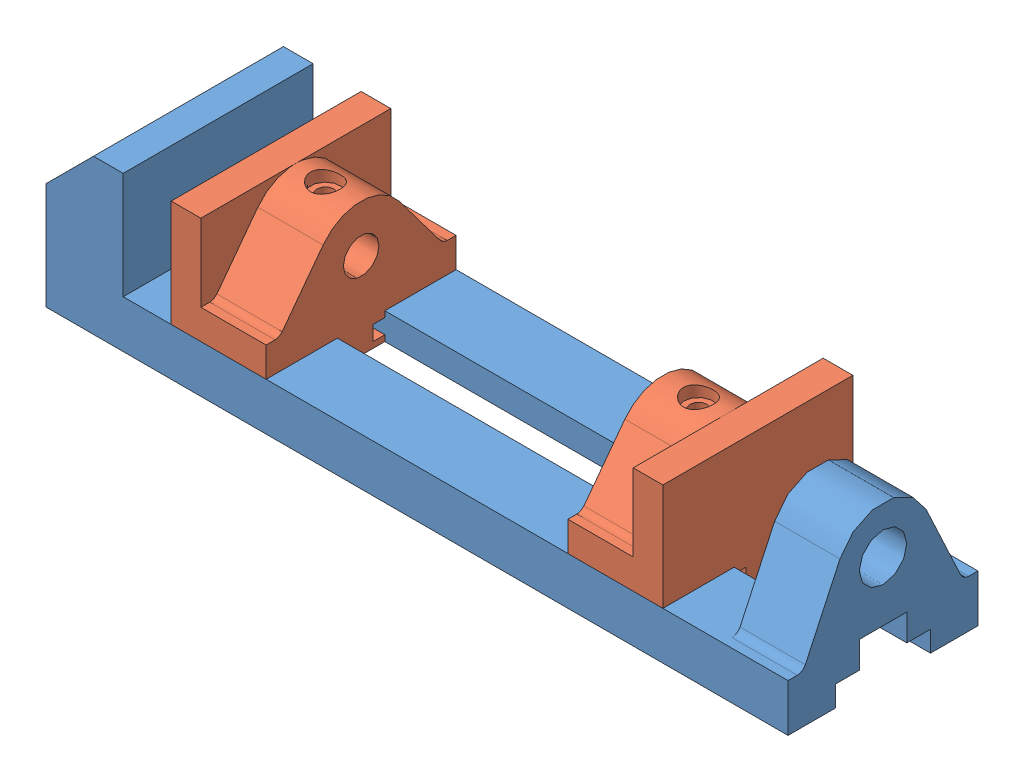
SolidWorks assembly Symmetric mate.SLDASM, configuration Default (file format 7000). Lengths in mm.
Overall size (250 52 64).
3 component instances, 2 part files, 6 mates.
Components (placement in the parent):
- vice-body-1: vice-body.SLDPRT [Default] at (-173.4267 -12.2974 16.2448) size (250 52 64)
- vice-jaw-1: vice-jaw.SLDPRT [Default] at (-131.2573 17.7026 16.2448) x (0 0 -1) z (1 0 0) size (64 45 32)
- vice-jaw-2: vice-jaw.SLDPRT [Default] at (34.4039 17.7026 16.2448) x (0 0 1) z (-1 0 0) size (64 45 32)
Mates (geometry in assembly coordinates):
- Coincident11: coincident anti-aligned: plane of vice-body-1 through (-173.4267 -5.2974 8.2448) normal (0 0 1); plane of vice-jaw-1 through (-99.2573 3.7026 8.2448) normal (0 0 -1)
- Coincident21: coincident anti-aligned: plane of vice-body-1 through (76.5733 3.7026 48.2448) normal (0 1 0); plane of vice-jaw-1 through (-99.2573 3.7026 -15.7552) normal (0 -1 0)
- Parallel11: parallel anti-aligned: plane of vice-body-1 through (-147.4267 3.7026 48.2448) normal (1 0 0); plane of vice-jaw-1 through (-131.2573 -5.2974 -15.7552) normal (-1 0 0)
- Coincident4: coincident anti-aligned: plane of vice-body-1 through (76.5733 3.7026 48.2448) normal (0 1 0); plane of vice-jaw-2 through (-0.9299 3.7026 48.2448) normal (0 -1 0)
- Coincident5: coincident anti-aligned: plane of vice-body-1 through (-173.4267 -5.2974 24.2448) normal (0 0 -1); plane of vice-jaw-2 through (-0.9299 3.7026 24.2448) normal (0 0 1)
- Symmetric2: symmetric anti-aligned: line of vice-jaw-1 through (-121.2573 39.7026 48.2448) axis (0 0 -1); line of vice-jaw-2 through (24.4039 39.7026 16.2448) axis (0 0 1); plane of assembly
